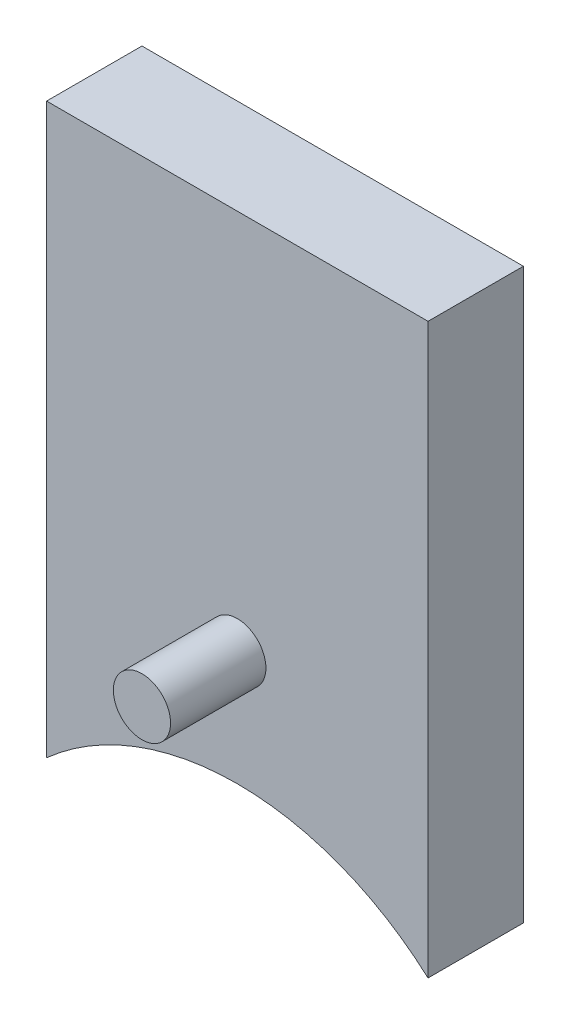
ISO-10303-21;
HEADER;
FILE_DESCRIPTION(('STEP AP214'),'2;1');
FILE_NAME('part.step','',(''),(''),'','','');
FILE_SCHEMA(('AUTOMOTIVE_DESIGN { 1 0 10303 214 1 1 1 1 }'));
ENDSEC;
DATA;
#1=APPLICATION_CONTEXT('core data for automotive mechanical design processes');
#2=APPLICATION_PROTOCOL_DEFINITION('international standard','automotive_design',2000,#1);
#3=PRODUCT_CONTEXT('',#1,'mechanical');
#4=PRODUCT('Part','Part','',(#3));
#5=PRODUCT_RELATED_PRODUCT_CATEGORY('part','',(#4));
#6=PRODUCT_DEFINITION_FORMATION('','',#4);
#7=PRODUCT_DEFINITION_CONTEXT('part definition',#1,'design');
#8=PRODUCT_DEFINITION('design','',#6,#7);
#9=PRODUCT_DEFINITION_SHAPE('','',#8);
#10=(LENGTH_UNIT() NAMED_UNIT(*) SI_UNIT(.MILLI.,.METRE.));
#11=(NAMED_UNIT(*) PLANE_ANGLE_UNIT() SI_UNIT($,.RADIAN.));
#12=(NAMED_UNIT(*) SI_UNIT($,.STERADIAN.) SOLID_ANGLE_UNIT());
#13=UNCERTAINTY_MEASURE_WITH_UNIT(LENGTH_MEASURE(1.E-05),#10,'distance_accuracy_value','');
#14=(GEOMETRIC_REPRESENTATION_CONTEXT(3) GLOBAL_UNCERTAINTY_ASSIGNED_CONTEXT((#13)) GLOBAL_UNIT_ASSIGNED_CONTEXT((#10,
#11,#12)) REPRESENTATION_CONTEXT('',''));
#15=CARTESIAN_POINT('',(0.,0.,0.));
#16=DIRECTION('',(0.,0.,1.));
#17=DIRECTION('',(1.,0.,0.));
#18=AXIS2_PLACEMENT_3D('',#15,#16,#17);
#19=CARTESIAN_POINT('',(10.,-9.81966011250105,-5.));
#20=DIRECTION('',(1.,0.,0.));
#21=DIRECTION('',(0.,1.,0.));
#22=AXIS2_PLACEMENT_3D('',#19,#20,#21);
#23=PLANE('',#22);
#24=DIRECTION('',(0.,1.,0.));
#25=VECTOR('',#24,1.);
#26=CARTESIAN_POINT('',(10.,-9.81966011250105,0.));
#27=LINE('',#26,#25);
#28=CARTESIAN_POINT('',(10.,-9.81966011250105,0.));
#29=VERTEX_POINT('',#28);
#30=CARTESIAN_POINT('',(10.,20.,0.));
#31=VERTEX_POINT('',#30);
#32=EDGE_CURVE('E97',#29,#31,#27,.T.);
#33=ORIENTED_EDGE('',*,*,#32,.F.);
#34=DIRECTION('',(0.,0.,1.));
#35=VECTOR('',#34,1.);
#36=CARTESIAN_POINT('',(10.,-9.81966011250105,-5.));
#37=LINE('',#36,#35);
#38=CARTESIAN_POINT('',(10.,-9.81966011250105,-5.));
#39=VERTEX_POINT('',#38);
#40=EDGE_CURVE('E11',#39,#29,#37,.T.);
#41=ORIENTED_EDGE('',*,*,#40,.F.);
#42=DIRECTION('',(0.,1.,0.));
#43=VECTOR('',#42,1.);
#44=CARTESIAN_POINT('',(10.,-9.81966011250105,-5.));
#45=LINE('',#44,#43);
#46=CARTESIAN_POINT('',(10.,20.,-5.));
#47=VERTEX_POINT('',#46);
#48=EDGE_CURVE('E90',#39,#47,#45,.T.);
#49=ORIENTED_EDGE('',*,*,#48,.T.);
#50=DIRECTION('',(0.,0.,1.));
#51=VECTOR('',#50,1.);
#52=CARTESIAN_POINT('',(10.,20.,-5.));
#53=LINE('',#52,#51);
#54=EDGE_CURVE('E35',#47,#31,#53,.T.);
#55=ORIENTED_EDGE('',*,*,#54,.T.);
#56=EDGE_LOOP('',(#33,#41,#49,#55));
#57=FACE_BOUND('',#56,.T.);
#58=ADVANCED_FACE('F32',(#57),#23,.T.);
#59=CARTESIAN_POINT('',(0.,-21.,-5.));
#60=DIRECTION('',(0.,0.,1.));
#61=DIRECTION('',(1.,0.,0.));
#62=AXIS2_PLACEMENT_3D('',#59,#60,#61);
#63=CYLINDRICAL_SURFACE('',#62,15.);
#64=CARTESIAN_POINT('',(0.,-21.,0.));
#65=DIRECTION('',(0.,0.,-1.));
#66=DIRECTION('',(-1.,0.,0.));
#67=AXIS2_PLACEMENT_3D('',#64,#65,#66);
#68=CIRCLE('',#67,15.);
#69=CARTESIAN_POINT('',(-10.,-9.81966011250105,0.));
#70=VERTEX_POINT('',#69);
#71=EDGE_CURVE('E92',#70,#29,#68,.T.);
#72=ORIENTED_EDGE('',*,*,#71,.F.);
#73=DIRECTION('',(0.,0.,1.));
#74=VECTOR('',#73,1.);
#75=CARTESIAN_POINT('',(-10.,-9.81966011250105,-5.));
#76=LINE('',#75,#74);
#77=CARTESIAN_POINT('',(-10.,-9.81966011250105,-5.));
#78=VERTEX_POINT('',#77);
#79=EDGE_CURVE('E41',#78,#70,#76,.T.);
#80=ORIENTED_EDGE('',*,*,#79,.F.);
#81=CARTESIAN_POINT('',(0.,-21.,-5.));
#82=DIRECTION('',(0.,0.,-1.));
#83=DIRECTION('',(-1.,0.,0.));
#84=AXIS2_PLACEMENT_3D('',#81,#82,#83);
#85=CIRCLE('',#84,15.);
#86=EDGE_CURVE('E87',#78,#39,#85,.T.);
#87=ORIENTED_EDGE('',*,*,#86,.T.);
#88=ORIENTED_EDGE('',*,*,#40,.T.);
#89=EDGE_LOOP('',(#72,#80,#87,#88));
#90=FACE_BOUND('',#89,.T.);
#91=ADVANCED_FACE('F108',(#90),#63,.F.);
#92=CARTESIAN_POINT('',(-10.,-9.81966011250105,-5.));
#93=DIRECTION('',(-1.,0.,0.));
#94=DIRECTION('',(0.,-1.,0.));
#95=AXIS2_PLACEMENT_3D('',#92,#93,#94);
#96=PLANE('',#95);
#97=DIRECTION('',(0.,-1.,0.));
#98=VECTOR('',#97,1.);
#99=CARTESIAN_POINT('',(-10.,-9.81966011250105,0.));
#100=LINE('',#99,#98);
#101=CARTESIAN_POINT('',(-10.,20.,0.));
#102=VERTEX_POINT('',#101);
#103=EDGE_CURVE('E82',#102,#70,#100,.T.);
#104=ORIENTED_EDGE('',*,*,#103,.F.);
#105=DIRECTION('',(0.,0.,1.));
#106=VECTOR('',#105,1.);
#107=CARTESIAN_POINT('',(-10.,20.,-5.));
#108=LINE('',#107,#106);
#109=CARTESIAN_POINT('',(-10.,20.,-5.));
#110=VERTEX_POINT('',#109);
#111=EDGE_CURVE('E77',#110,#102,#108,.T.);
#112=ORIENTED_EDGE('',*,*,#111,.F.);
#113=DIRECTION('',(0.,-1.,0.));
#114=VECTOR('',#113,1.);
#115=CARTESIAN_POINT('',(-10.,-9.81966011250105,-5.));
#116=LINE('',#115,#114);
#117=EDGE_CURVE('E80',#110,#78,#116,.T.);
#118=ORIENTED_EDGE('',*,*,#117,.T.);
#119=ORIENTED_EDGE('',*,*,#79,.T.);
#120=EDGE_LOOP('',(#104,#112,#118,#119));
#121=FACE_BOUND('',#120,.T.);
#122=ADVANCED_FACE('F79',(#121),#96,.T.);
#123=CARTESIAN_POINT('',(-10.,20.,-5.));
#124=DIRECTION('',(0.,1.,0.));
#125=DIRECTION('',(0.,0.,1.));
#126=AXIS2_PLACEMENT_3D('',#123,#124,#125);
#127=PLANE('',#126);
#128=DIRECTION('',(-1.,0.,0.));
#129=VECTOR('',#128,1.);
#130=CARTESIAN_POINT('',(-10.,20.,0.));
#131=LINE('',#130,#129);
#132=EDGE_CURVE('E100',#31,#102,#131,.T.);
#133=ORIENTED_EDGE('',*,*,#132,.F.);
#134=ORIENTED_EDGE('',*,*,#54,.F.);
#135=DIRECTION('',(-1.,0.,0.));
#136=VECTOR('',#135,1.);
#137=CARTESIAN_POINT('',(-10.,20.,-5.));
#138=LINE('',#137,#136);
#139=EDGE_CURVE('E86',#47,#110,#138,.T.);
#140=ORIENTED_EDGE('',*,*,#139,.T.);
#141=ORIENTED_EDGE('',*,*,#111,.T.);
#142=EDGE_LOOP('',(#133,#134,#140,#141));
#143=FACE_BOUND('',#142,.T.);
#144=ADVANCED_FACE('F89',(#143),#127,.T.);
#145=CARTESIAN_POINT('',(0.,-21.,-5.));
#146=DIRECTION('',(0.,0.,-1.));
#147=DIRECTION('',(-1.,0.,0.));
#148=AXIS2_PLACEMENT_3D('',#145,#146,#147);
#149=PLANE('',#148);
#150=ORIENTED_EDGE('',*,*,#48,.F.);
#151=ORIENTED_EDGE('',*,*,#86,.F.);
#152=ORIENTED_EDGE('',*,*,#117,.F.);
#153=ORIENTED_EDGE('',*,*,#139,.F.);
#154=EDGE_LOOP('',(#150,#151,#152,#153));
#155=FACE_BOUND('',#154,.T.);
#156=ADVANCED_FACE('F85',(#155),#149,.T.);
#157=CARTESIAN_POINT('',(0.,-21.,0.));
#158=DIRECTION('',(0.,0.,-1.));
#159=DIRECTION('',(-1.,0.,0.));
#160=AXIS2_PLACEMENT_3D('',#157,#158,#159);
#161=PLANE('',#160);
#162=CARTESIAN_POINT('',(0.,0.,0.));
#163=DIRECTION('',(0.,0.,1.));
#164=DIRECTION('',(1.,0.,0.));
#165=AXIS2_PLACEMENT_3D('',#162,#163,#164);
#166=CIRCLE('',#165,1.5);
#167=CARTESIAN_POINT('',(1.5,0.,0.));
#168=VERTEX_POINT('',#167);
#169=EDGE_CURVE('E101',#168,#168,#166,.T.);
#170=ORIENTED_EDGE('',*,*,#169,.F.);
#171=EDGE_LOOP('',(#170));
#172=FACE_BOUND('',#171,.T.);
#173=ORIENTED_EDGE('',*,*,#32,.T.);
#174=ORIENTED_EDGE('',*,*,#132,.T.);
#175=ORIENTED_EDGE('',*,*,#103,.T.);
#176=ORIENTED_EDGE('',*,*,#71,.T.);
#177=EDGE_LOOP('',(#173,#174,#175,#176));
#178=FACE_BOUND('',#177,.T.);
#179=ADVANCED_FACE('F107',(#172,#178),#161,.F.);
#180=CARTESIAN_POINT('',(0.,0.,5.));
#181=DIRECTION('',(0.,0.,-1.));
#182=DIRECTION('',(-1.,0.,0.));
#183=AXIS2_PLACEMENT_3D('',#180,#181,#182);
#184=CYLINDRICAL_SURFACE('',#183,1.5);
#185=CARTESIAN_POINT('',(0.,0.,5.));
#186=DIRECTION('',(0.,0.,1.));
#187=DIRECTION('',(1.,0.,0.));
#188=AXIS2_PLACEMENT_3D('',#185,#186,#187);
#189=CIRCLE('',#188,1.5);
#190=CARTESIAN_POINT('',(1.5,0.,5.));
#191=VERTEX_POINT('',#190);
#192=EDGE_CURVE('E138',#191,#191,#189,.T.);
#193=ORIENTED_EDGE('',*,*,#192,.F.);
#194=EDGE_LOOP('',(#193));
#195=FACE_BOUND('',#194,.T.);
#196=ORIENTED_EDGE('',*,*,#169,.T.);
#197=EDGE_LOOP('',(#196));
#198=FACE_BOUND('',#197,.T.);
#199=ADVANCED_FACE('F125',(#195,#198),#184,.T.);
#200=CARTESIAN_POINT('',(0.,0.,5.));
#201=DIRECTION('',(0.,0.,1.));
#202=DIRECTION('',(1.,0.,0.));
#203=AXIS2_PLACEMENT_3D('',#200,#201,#202);
#204=PLANE('',#203);
#205=ORIENTED_EDGE('',*,*,#192,.T.);
#206=EDGE_LOOP('',(#205));
#207=FACE_BOUND('',#206,.T.);
#208=ADVANCED_FACE('F130',(#207),#204,.T.);
#209=CLOSED_SHELL('',(#58,#91,#122,#144,#156,#179,#199,#208));
#210=MANIFOLD_SOLID_BREP('B2',#209);
#211=ADVANCED_BREP_SHAPE_REPRESENTATION('',(#18,#210),#14);
#212=SHAPE_DEFINITION_REPRESENTATION(#9,#211);
ENDSEC;
END-ISO-10303-21;
